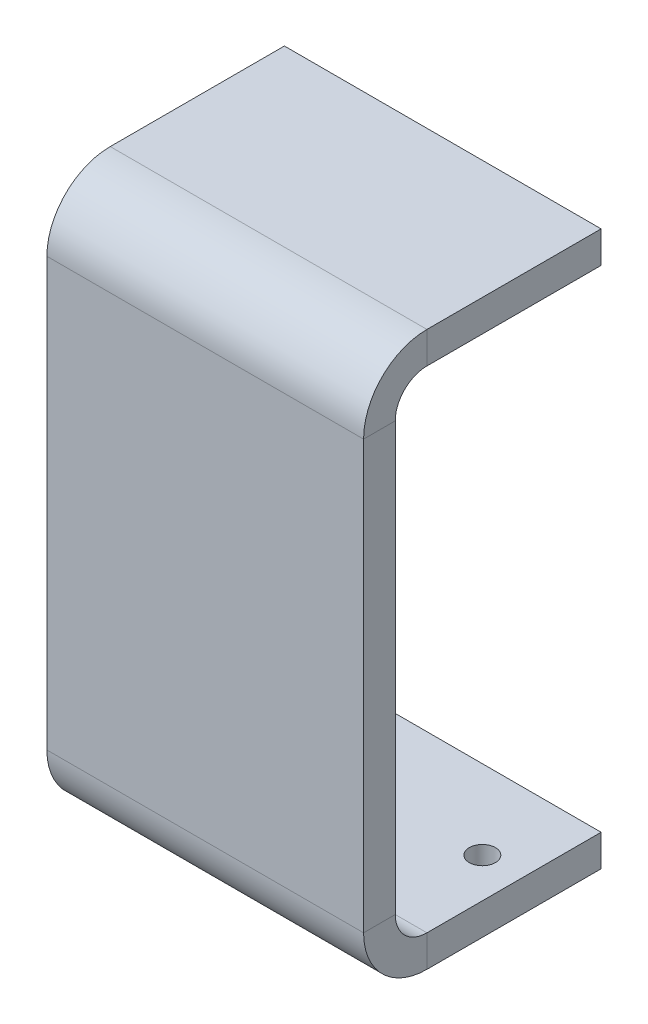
ISO-10303-21;
HEADER;
FILE_DESCRIPTION(('STEP AP214'),'2;1');
FILE_NAME('part.step','',(''),(''),'','','');
FILE_SCHEMA(('AUTOMOTIVE_DESIGN { 1 0 10303 214 1 1 1 1 }'));
ENDSEC;
DATA;
#1=APPLICATION_CONTEXT('core data for automotive mechanical design processes');
#2=APPLICATION_PROTOCOL_DEFINITION('international standard','automotive_design',2000,#1);
#3=PRODUCT_CONTEXT('',#1,'mechanical');
#4=PRODUCT('Part','Part','',(#3));
#5=PRODUCT_RELATED_PRODUCT_CATEGORY('part','',(#4));
#6=PRODUCT_DEFINITION_FORMATION('','',#4);
#7=PRODUCT_DEFINITION_CONTEXT('part definition',#1,'design');
#8=PRODUCT_DEFINITION('design','',#6,#7);
#9=PRODUCT_DEFINITION_SHAPE('','',#8);
#10=(LENGTH_UNIT() NAMED_UNIT(*) SI_UNIT(.MILLI.,.METRE.));
#11=(NAMED_UNIT(*) PLANE_ANGLE_UNIT() SI_UNIT($,.RADIAN.));
#12=(NAMED_UNIT(*) SI_UNIT($,.STERADIAN.) SOLID_ANGLE_UNIT());
#13=UNCERTAINTY_MEASURE_WITH_UNIT(LENGTH_MEASURE(1.E-05),#10,'distance_accuracy_value','');
#14=(GEOMETRIC_REPRESENTATION_CONTEXT(3) GLOBAL_UNCERTAINTY_ASSIGNED_CONTEXT((#13)) GLOBAL_UNIT_ASSIGNED_CONTEXT((#10,
#11,#12)) REPRESENTATION_CONTEXT('',''));
#15=CARTESIAN_POINT('',(0.,0.,0.));
#16=DIRECTION('',(0.,0.,1.));
#17=DIRECTION('',(1.,0.,0.));
#18=AXIS2_PLACEMENT_3D('',#15,#16,#17);
#19=CARTESIAN_POINT('',(20.,8.00000000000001,30.));
#20=DIRECTION('',(1.,0.,0.));
#21=DIRECTION('',(0.,0.,-0.999999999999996));
#22=AXIS2_PLACEMENT_3D('',#19,#20,#21);
#23=PLANE('',#22);
#24=DIRECTION('',(0.,0.,-0.999999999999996));
#25=VECTOR('',#24,1.);
#26=CARTESIAN_POINT('',(20.,8.00000000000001,30.));
#27=LINE('',#26,#25);
#28=CARTESIAN_POINT('',(20.,8.00000000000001,30.));
#29=VERTEX_POINT('',#28);
#30=CARTESIAN_POINT('',(20.,8.00000000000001,26.));
#31=VERTEX_POINT('',#30);
#32=EDGE_CURVE('E11',#29,#31,#27,.T.);
#33=ORIENTED_EDGE('',*,*,#32,.F.);
#34=CARTESIAN_POINT('',(19.9999999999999,8.00000000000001,22.));
#35=DIRECTION('',(1.,0.,0.));
#36=DIRECTION('',(0.,0.,-0.999999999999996));
#37=AXIS2_PLACEMENT_3D('',#34,#35,#36);
#38=CIRCLE('',#37,8.);
#39=CARTESIAN_POINT('',(19.9999999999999,0.,22.));
#40=VERTEX_POINT('',#39);
#41=EDGE_CURVE('E222',#40,#29,#38,.F.);
#42=ORIENTED_EDGE('',*,*,#41,.F.);
#43=DIRECTION('',(0.,-1.,0.));
#44=VECTOR('',#43,1.);
#45=CARTESIAN_POINT('',(19.9999999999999,4.,22.));
#46=LINE('',#45,#44);
#47=CARTESIAN_POINT('',(19.9999999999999,4.,22.));
#48=VERTEX_POINT('',#47);
#49=EDGE_CURVE('E53',#48,#40,#46,.T.);
#50=ORIENTED_EDGE('',*,*,#49,.F.);
#51=CARTESIAN_POINT('',(19.9999999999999,8.00000000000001,22.));
#52=DIRECTION('',(1.,0.,0.));
#53=DIRECTION('',(0.,0.,-0.999999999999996));
#54=AXIS2_PLACEMENT_3D('',#51,#52,#53);
#55=CIRCLE('',#54,4.);
#56=EDGE_CURVE('E237',#48,#31,#55,.F.);
#57=ORIENTED_EDGE('',*,*,#56,.T.);
#58=EDGE_LOOP('',(#33,#42,#50,#57));
#59=FACE_BOUND('',#58,.T.);
#60=ADVANCED_FACE('F44',(#59),#23,.T.);
#61=CARTESIAN_POINT('',(19.9999999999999,4.,22.));
#62=DIRECTION('',(1.,0.,0.));
#63=DIRECTION('',(0.,0.,-0.999999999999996));
#64=AXIS2_PLACEMENT_3D('',#61,#62,#63);
#65=PLANE('',#64);
#66=DIRECTION('',(0.,1.,0.));
#67=VECTOR('',#66,1.);
#68=CARTESIAN_POINT('',(20.,0.,30.));
#69=LINE('',#68,#67);
#70=CARTESIAN_POINT('',(20.,62.0000000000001,29.999999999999));
#71=VERTEX_POINT('',#70);
#72=EDGE_CURVE('E218',#29,#71,#69,.T.);
#73=ORIENTED_EDGE('',*,*,#72,.F.);
#74=ORIENTED_EDGE('',*,*,#32,.T.);
#75=DIRECTION('',(0.,1.,0.));
#76=VECTOR('',#75,1.);
#77=CARTESIAN_POINT('',(20.,0.,26.));
#78=LINE('',#77,#76);
#79=CARTESIAN_POINT('',(20.,62.0000000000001,25.999999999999));
#80=VERTEX_POINT('',#79);
#81=EDGE_CURVE('E241',#31,#80,#78,.T.);
#82=ORIENTED_EDGE('',*,*,#81,.T.);
#83=DIRECTION('',(0.,0.,0.999999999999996));
#84=VECTOR('',#83,1.);
#85=CARTESIAN_POINT('',(20.,62.0000000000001,25.999999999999));
#86=LINE('',#85,#84);
#87=EDGE_CURVE('E68',#80,#71,#86,.T.);
#88=ORIENTED_EDGE('',*,*,#87,.T.);
#89=EDGE_LOOP('',(#73,#74,#82,#88));
#90=FACE_BOUND('',#89,.T.);
#91=ADVANCED_FACE('F353',(#90),#65,.T.);
#92=CARTESIAN_POINT('',(-20.0000000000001,0.,21.9999999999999));
#93=DIRECTION('',(-1.,0.,0.));
#94=DIRECTION('',(0.,0.,0.999999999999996));
#95=AXIS2_PLACEMENT_3D('',#92,#93,#94);
#96=PLANE('',#95);
#97=DIRECTION('',(0.,1.,0.));
#98=VECTOR('',#97,1.);
#99=CARTESIAN_POINT('',(-20.0000000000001,0.,21.9999999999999));
#100=LINE('',#99,#98);
#101=CARTESIAN_POINT('',(-20.0000000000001,0.,21.9999999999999));
#102=VERTEX_POINT('',#101);
#103=CARTESIAN_POINT('',(-20.0000000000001,4.,21.9999999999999));
#104=VERTEX_POINT('',#103);
#105=EDGE_CURVE('E297',#102,#104,#100,.T.);
#106=ORIENTED_EDGE('',*,*,#105,.F.);
#107=CARTESIAN_POINT('',(-20.0000000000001,8.00000000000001,21.9999999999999));
#108=DIRECTION('',(1.,0.,0.));
#109=DIRECTION('',(0.,0.,-0.999999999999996));
#110=AXIS2_PLACEMENT_3D('',#107,#108,#109);
#111=CIRCLE('',#110,8.);
#112=CARTESIAN_POINT('',(-20.,8.00000000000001,29.9999999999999));
#113=VERTEX_POINT('',#112);
#114=EDGE_CURVE('E178',#102,#113,#111,.F.);
#115=ORIENTED_EDGE('',*,*,#114,.T.);
#116=DIRECTION('',(0.,0.,0.999999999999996));
#117=VECTOR('',#116,1.);
#118=CARTESIAN_POINT('',(-20.,8.00000000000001,25.9999999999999));
#119=LINE('',#118,#117);
#120=CARTESIAN_POINT('',(-20.,8.00000000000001,25.9999999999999));
#121=VERTEX_POINT('',#120);
#122=EDGE_CURVE('E294',#121,#113,#119,.T.);
#123=ORIENTED_EDGE('',*,*,#122,.F.);
#124=CARTESIAN_POINT('',(-20.0000000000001,8.00000000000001,21.9999999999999));
#125=DIRECTION('',(1.,0.,0.));
#126=DIRECTION('',(0.,0.,-0.999999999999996));
#127=AXIS2_PLACEMENT_3D('',#124,#125,#126);
#128=CIRCLE('',#127,4.);
#129=EDGE_CURVE('E193',#104,#121,#128,.F.);
#130=ORIENTED_EDGE('',*,*,#129,.F.);
#131=EDGE_LOOP('',(#106,#115,#123,#130));
#132=FACE_BOUND('',#131,.T.);
#133=ADVANCED_FACE('F381',(#132),#96,.T.);
#134=CARTESIAN_POINT('',(-20.,8.00000000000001,25.9999999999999));
#135=DIRECTION('',(-1.,0.,0.));
#136=DIRECTION('',(0.,0.,0.999999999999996));
#137=AXIS2_PLACEMENT_3D('',#134,#135,#136);
#138=PLANE('',#137);
#139=DIRECTION('',(0.,0.,0.999999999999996));
#140=VECTOR('',#139,1.);
#141=CARTESIAN_POINT('',(-20.,0.,-1.11022302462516E-13));
#142=LINE('',#141,#140);
#143=CARTESIAN_POINT('',(-20.,0.,-1.11022302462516E-13));
#144=VERTEX_POINT('',#143);
#145=EDGE_CURVE('E181',#144,#102,#142,.T.);
#146=ORIENTED_EDGE('',*,*,#145,.T.);
#147=ORIENTED_EDGE('',*,*,#105,.T.);
#148=DIRECTION('',(0.,0.,0.999999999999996));
#149=VECTOR('',#148,1.);
#150=CARTESIAN_POINT('',(-20.,4.,-1.11022302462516E-13));
#151=LINE('',#150,#149);
#152=CARTESIAN_POINT('',(-20.,4.,-1.11022302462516E-13));
#153=VERTEX_POINT('',#152);
#154=EDGE_CURVE('E189',#153,#104,#151,.T.);
#155=ORIENTED_EDGE('',*,*,#154,.F.);
#156=DIRECTION('',(0.,-1.,0.));
#157=VECTOR('',#156,1.);
#158=CARTESIAN_POINT('',(-20.,4.,-1.11022302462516E-13));
#159=LINE('',#158,#157);
#160=EDGE_CURVE('E185',#153,#144,#159,.T.);
#161=ORIENTED_EDGE('',*,*,#160,.T.);
#162=EDGE_LOOP('',(#146,#147,#155,#161));
#163=FACE_BOUND('',#162,.T.);
#164=ADVANCED_FACE('F335',(#163),#138,.T.);
#165=CARTESIAN_POINT('',(19.9999999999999,70.0000000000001,21.999999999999));
#166=DIRECTION('',(1.,0.,0.));
#167=DIRECTION('',(0.,0.,-0.999999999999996));
#168=AXIS2_PLACEMENT_3D('',#165,#166,#167);
#169=PLANE('',#168);
#170=DIRECTION('',(0.,-1.,0.));
#171=VECTOR('',#170,1.);
#172=CARTESIAN_POINT('',(19.9999999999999,70.0000000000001,21.999999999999));
#173=LINE('',#172,#171);
#174=CARTESIAN_POINT('',(19.9999999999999,70.0000000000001,21.999999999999));
#175=VERTEX_POINT('',#174);
#176=CARTESIAN_POINT('',(19.9999999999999,66.0000000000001,21.999999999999));
#177=VERTEX_POINT('',#176);
#178=EDGE_CURVE('E61',#175,#177,#173,.T.);
#179=ORIENTED_EDGE('',*,*,#178,.F.);
#180=CARTESIAN_POINT('',(19.9999999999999,62.0000000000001,21.999999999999));
#181=DIRECTION('',(1.,0.,0.));
#182=DIRECTION('',(0.,0.,-0.999999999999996));
#183=AXIS2_PLACEMENT_3D('',#180,#181,#182);
#184=CIRCLE('',#183,8.);
#185=EDGE_CURVE('E214',#71,#175,#184,.F.);
#186=ORIENTED_EDGE('',*,*,#185,.F.);
#187=ORIENTED_EDGE('',*,*,#87,.F.);
#188=CARTESIAN_POINT('',(19.9999999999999,62.0000000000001,21.999999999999));
#189=DIRECTION('',(1.,0.,0.));
#190=DIRECTION('',(0.,0.,-0.999999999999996));
#191=AXIS2_PLACEMENT_3D('',#188,#189,#190);
#192=CIRCLE('',#191,4.);
#193=EDGE_CURVE('E244',#80,#177,#192,.F.);
#194=ORIENTED_EDGE('',*,*,#193,.T.);
#195=EDGE_LOOP('',(#179,#186,#187,#194));
#196=FACE_BOUND('',#195,.T.);
#197=ADVANCED_FACE('F360',(#196),#169,.T.);
#198=CARTESIAN_POINT('',(20.,62.0000000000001,25.999999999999));
#199=DIRECTION('',(1.,0.,0.));
#200=DIRECTION('',(0.,0.,-0.999999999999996));
#201=AXIS2_PLACEMENT_3D('',#198,#199,#200);
#202=PLANE('',#201);
#203=DIRECTION('',(0.,0.,-0.999999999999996));
#204=VECTOR('',#203,1.);
#205=CARTESIAN_POINT('',(20.,70.0000000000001,29.999999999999));
#206=LINE('',#205,#204);
#207=CARTESIAN_POINT('',(20.,70.0000000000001,0.));
#208=VERTEX_POINT('',#207);
#209=EDGE_CURVE('E210',#175,#208,#206,.T.);
#210=ORIENTED_EDGE('',*,*,#209,.F.);
#211=ORIENTED_EDGE('',*,*,#178,.T.);
#212=DIRECTION('',(0.,0.,-0.999999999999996));
#213=VECTOR('',#212,1.);
#214=CARTESIAN_POINT('',(20.,66.0000000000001,29.999999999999));
#215=LINE('',#214,#213);
#216=CARTESIAN_POINT('',(20.,66.0000000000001,0.));
#217=VERTEX_POINT('',#216);
#218=EDGE_CURVE('E205',#177,#217,#215,.T.);
#219=ORIENTED_EDGE('',*,*,#218,.T.);
#220=DIRECTION('',(0.,-1.,0.));
#221=VECTOR('',#220,1.);
#222=CARTESIAN_POINT('',(20.,70.0000000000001,0.));
#223=LINE('',#222,#221);
#224=EDGE_CURVE('E142',#208,#217,#223,.T.);
#225=ORIENTED_EDGE('',*,*,#224,.F.);
#226=EDGE_LOOP('',(#210,#211,#219,#225));
#227=FACE_BOUND('',#226,.T.);
#228=ADVANCED_FACE('F365',(#227),#202,.T.);
#229=CARTESIAN_POINT('',(-20.,62.0000000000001,29.9999999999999));
#230=DIRECTION('',(-1.,0.,0.));
#231=DIRECTION('',(0.,0.,0.999999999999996));
#232=AXIS2_PLACEMENT_3D('',#229,#230,#231);
#233=PLANE('',#232);
#234=DIRECTION('',(0.,0.,-0.999999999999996));
#235=VECTOR('',#234,1.);
#236=CARTESIAN_POINT('',(-20.,62.0000000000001,29.9999999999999));
#237=LINE('',#236,#235);
#238=CARTESIAN_POINT('',(-20.,62.0000000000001,29.9999999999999));
#239=VERTEX_POINT('',#238);
#240=CARTESIAN_POINT('',(-20.,62.0000000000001,25.9999999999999));
#241=VERTEX_POINT('',#240);
#242=EDGE_CURVE('E287',#239,#241,#237,.T.);
#243=ORIENTED_EDGE('',*,*,#242,.F.);
#244=CARTESIAN_POINT('',(-20.0000000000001,62.0000000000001,21.9999999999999));
#245=DIRECTION('',(1.,0.,0.));
#246=DIRECTION('',(0.,0.,-0.999999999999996));
#247=AXIS2_PLACEMENT_3D('',#244,#245,#246);
#248=CIRCLE('',#247,8.);
#249=CARTESIAN_POINT('',(-20.0000000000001,70.0000000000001,21.9999999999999));
#250=VERTEX_POINT('',#249);
#251=EDGE_CURVE('E167',#239,#250,#248,.F.);
#252=ORIENTED_EDGE('',*,*,#251,.T.);
#253=DIRECTION('',(0.,1.,0.));
#254=VECTOR('',#253,1.);
#255=CARTESIAN_POINT('',(-20.0000000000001,66.0000000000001,21.9999999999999));
#256=LINE('',#255,#254);
#257=CARTESIAN_POINT('',(-20.0000000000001,66.0000000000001,21.9999999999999));
#258=VERTEX_POINT('',#257);
#259=EDGE_CURVE('E146',#258,#250,#256,.T.);
#260=ORIENTED_EDGE('',*,*,#259,.F.);
#261=CARTESIAN_POINT('',(-20.0000000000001,62.0000000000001,21.9999999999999));
#262=DIRECTION('',(1.,0.,0.));
#263=DIRECTION('',(0.,0.,-0.999999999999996));
#264=AXIS2_PLACEMENT_3D('',#261,#262,#263);
#265=CIRCLE('',#264,4.);
#266=EDGE_CURVE('E201',#241,#258,#265,.F.);
#267=ORIENTED_EDGE('',*,*,#266,.F.);
#268=EDGE_LOOP('',(#243,#252,#260,#267));
#269=FACE_BOUND('',#268,.T.);
#270=ADVANCED_FACE('F367',(#269),#233,.T.);
#271=CARTESIAN_POINT('',(-20.0000000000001,66.0000000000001,21.9999999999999));
#272=DIRECTION('',(-1.,0.,0.));
#273=DIRECTION('',(0.,0.,0.999999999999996));
#274=AXIS2_PLACEMENT_3D('',#271,#272,#273);
#275=PLANE('',#274);
#276=DIRECTION('',(0.,1.,0.));
#277=VECTOR('',#276,1.);
#278=CARTESIAN_POINT('',(-20.,0.,29.9999999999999));
#279=LINE('',#278,#277);
#280=EDGE_CURVE('E174',#113,#239,#279,.T.);
#281=ORIENTED_EDGE('',*,*,#280,.T.);
#282=ORIENTED_EDGE('',*,*,#242,.T.);
#283=DIRECTION('',(0.,1.,0.));
#284=VECTOR('',#283,1.);
#285=CARTESIAN_POINT('',(-20.,0.,25.9999999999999));
#286=LINE('',#285,#284);
#287=EDGE_CURVE('E197',#121,#241,#286,.T.);
#288=ORIENTED_EDGE('',*,*,#287,.F.);
#289=ORIENTED_EDGE('',*,*,#122,.T.);
#290=EDGE_LOOP('',(#281,#282,#288,#289));
#291=FACE_BOUND('',#290,.T.);
#292=ADVANCED_FACE('F373',(#291),#275,.T.);
#293=CARTESIAN_POINT('',(20.,66.0000000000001,29.999999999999));
#294=DIRECTION('',(0.,1.,0.));
#295=DIRECTION('',(0.,0.,0.999999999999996));
#296=AXIS2_PLACEMENT_3D('',#293,#294,#295);
#297=PLANE('',#296);
#298=DIRECTION('',(0.,0.,-0.999999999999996));
#299=VECTOR('',#298,1.);
#300=CARTESIAN_POINT('',(-20.,66.0000000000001,29.9999999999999));
#301=LINE('',#300,#299);
#302=CARTESIAN_POINT('',(-20.,66.0000000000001,-1.11022302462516E-13));
#303=VERTEX_POINT('',#302);
#304=EDGE_CURVE('E151',#258,#303,#301,.T.);
#305=ORIENTED_EDGE('',*,*,#304,.T.);
#306=DIRECTION('',(-1.,0.,0.));
#307=VECTOR('',#306,1.);
#308=CARTESIAN_POINT('',(20.,66.0000000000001,0.));
#309=LINE('',#308,#307);
#310=EDGE_CURVE('E135',#217,#303,#309,.T.);
#311=ORIENTED_EDGE('',*,*,#310,.F.);
#312=ORIENTED_EDGE('',*,*,#218,.F.);
#313=DIRECTION('',(-1.,0.,0.));
#314=VECTOR('',#313,1.);
#315=CARTESIAN_POINT('',(19.9999999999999,66.0000000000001,21.999999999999));
#316=LINE('',#315,#314);
#317=EDGE_CURVE('E154',#177,#258,#316,.T.);
#318=ORIENTED_EDGE('',*,*,#317,.T.);
#319=EDGE_LOOP('',(#305,#311,#312,#318));
#320=FACE_BOUND('',#319,.T.);
#321=ADVANCED_FACE('F152',(#320),#297,.F.);
#322=CARTESIAN_POINT('',(20.,70.0000000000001,0.));
#323=DIRECTION('',(0.,0.,-0.999999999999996));
#324=DIRECTION('',(-1.,0.,0.));
#325=AXIS2_PLACEMENT_3D('',#322,#323,#324);
#326=PLANE('',#325);
#327=DIRECTION('',(0.,-1.,0.));
#328=VECTOR('',#327,1.);
#329=CARTESIAN_POINT('',(-20.,70.0000000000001,-1.11022302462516E-13));
#330=LINE('',#329,#328);
#331=CARTESIAN_POINT('',(-20.,70.0000000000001,-1.11022302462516E-13));
#332=VERTEX_POINT('',#331);
#333=EDGE_CURVE('E139',#332,#303,#330,.T.);
#334=ORIENTED_EDGE('',*,*,#333,.F.);
#335=DIRECTION('',(-1.,0.,0.));
#336=VECTOR('',#335,1.);
#337=CARTESIAN_POINT('',(20.,70.0000000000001,0.));
#338=LINE('',#337,#336);
#339=EDGE_CURVE('E147',#208,#332,#338,.T.);
#340=ORIENTED_EDGE('',*,*,#339,.F.);
#341=ORIENTED_EDGE('',*,*,#224,.T.);
#342=ORIENTED_EDGE('',*,*,#310,.T.);
#343=EDGE_LOOP('',(#334,#340,#341,#342));
#344=FACE_BOUND('',#343,.T.);
#345=ADVANCED_FACE('F137',(#344),#326,.T.);
#346=CARTESIAN_POINT('',(20.,70.0000000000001,29.999999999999));
#347=DIRECTION('',(0.,1.,0.));
#348=DIRECTION('',(0.,0.,0.999999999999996));
#349=AXIS2_PLACEMENT_3D('',#346,#347,#348);
#350=PLANE('',#349);
#351=DIRECTION('',(0.,0.,-0.999999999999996));
#352=VECTOR('',#351,1.);
#353=CARTESIAN_POINT('',(-20.,70.0000000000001,29.9999999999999));
#354=LINE('',#353,#352);
#355=EDGE_CURVE('E161',#250,#332,#354,.T.);
#356=ORIENTED_EDGE('',*,*,#355,.F.);
#357=DIRECTION('',(-1.,0.,0.));
#358=VECTOR('',#357,1.);
#359=CARTESIAN_POINT('',(19.9999999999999,70.0000000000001,21.999999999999));
#360=LINE('',#359,#358);
#361=EDGE_CURVE('E279',#175,#250,#360,.T.);
#362=ORIENTED_EDGE('',*,*,#361,.F.);
#363=ORIENTED_EDGE('',*,*,#209,.T.);
#364=ORIENTED_EDGE('',*,*,#339,.T.);
#365=EDGE_LOOP('',(#356,#362,#363,#364));
#366=FACE_BOUND('',#365,.T.);
#367=ADVANCED_FACE('F364',(#366),#350,.T.);
#368=CARTESIAN_POINT('',(19.9999999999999,62.0000000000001,21.999999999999));
#369=DIRECTION('',(-1.,0.,0.));
#370=DIRECTION('',(0.,0.,0.999999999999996));
#371=AXIS2_PLACEMENT_3D('',#368,#369,#370);
#372=CYLINDRICAL_SURFACE('',#371,8.);
#373=ORIENTED_EDGE('',*,*,#251,.F.);
#374=DIRECTION('',(-1.,0.,0.));
#375=VECTOR('',#374,1.);
#376=CARTESIAN_POINT('',(20.,62.0000000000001,29.999999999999));
#377=LINE('',#376,#375);
#378=EDGE_CURVE('E275',#71,#239,#377,.T.);
#379=ORIENTED_EDGE('',*,*,#378,.F.);
#380=ORIENTED_EDGE('',*,*,#185,.T.);
#381=ORIENTED_EDGE('',*,*,#361,.T.);
#382=EDGE_LOOP('',(#373,#379,#380,#381));
#383=FACE_BOUND('',#382,.T.);
#384=ADVANCED_FACE('F359',(#383),#372,.T.);
#385=CARTESIAN_POINT('',(20.,0.,30.));
#386=DIRECTION('',(0.,0.,0.999999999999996));
#387=DIRECTION('',(1.,0.,0.));
#388=AXIS2_PLACEMENT_3D('',#385,#386,#387);
#389=PLANE('',#388);
#390=ORIENTED_EDGE('',*,*,#280,.F.);
#391=DIRECTION('',(-1.,0.,0.));
#392=VECTOR('',#391,1.);
#393=CARTESIAN_POINT('',(20.,8.00000000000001,30.));
#394=LINE('',#393,#392);
#395=EDGE_CURVE('E271',#29,#113,#394,.T.);
#396=ORIENTED_EDGE('',*,*,#395,.F.);
#397=ORIENTED_EDGE('',*,*,#72,.T.);
#398=ORIENTED_EDGE('',*,*,#378,.T.);
#399=EDGE_LOOP('',(#390,#396,#397,#398));
#400=FACE_BOUND('',#399,.T.);
#401=ADVANCED_FACE('F352',(#400),#389,.T.);
#402=CARTESIAN_POINT('',(19.9999999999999,8.00000000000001,22.));
#403=DIRECTION('',(-1.,0.,0.));
#404=DIRECTION('',(0.,0.,0.999999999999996));
#405=AXIS2_PLACEMENT_3D('',#402,#403,#404);
#406=CYLINDRICAL_SURFACE('',#405,8.);
#407=ORIENTED_EDGE('',*,*,#114,.F.);
#408=DIRECTION('',(-1.,0.,0.));
#409=VECTOR('',#408,1.);
#410=CARTESIAN_POINT('',(19.9999999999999,0.,22.));
#411=LINE('',#410,#409);
#412=EDGE_CURVE('E267',#40,#102,#411,.T.);
#413=ORIENTED_EDGE('',*,*,#412,.F.);
#414=ORIENTED_EDGE('',*,*,#41,.T.);
#415=ORIENTED_EDGE('',*,*,#395,.T.);
#416=EDGE_LOOP('',(#407,#413,#414,#415));
#417=FACE_BOUND('',#416,.T.);
#418=ADVANCED_FACE('F325',(#417),#406,.T.);
#419=CARTESIAN_POINT('',(20.,0.,0.));
#420=DIRECTION('',(0.,-1.,0.));
#421=DIRECTION('',(0.,0.,-0.999999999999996));
#422=AXIS2_PLACEMENT_3D('',#419,#420,#421);
#423=PLANE('',#422);
#424=CARTESIAN_POINT('',(15.,0.,10.));
#425=DIRECTION('',(0.,-1.,0.));
#426=DIRECTION('',(0.,0.,-0.999999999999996));
#427=AXIS2_PLACEMENT_3D('',#424,#425,#426);
#428=CIRCLE('',#427,1.64999999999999);
#429=CARTESIAN_POINT('',(15.,0.,8.35000000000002));
#430=VERTEX_POINT('',#429);
#431=EDGE_CURVE('E313',#430,#430,#428,.T.);
#432=ORIENTED_EDGE('',*,*,#431,.F.);
#433=EDGE_LOOP('',(#432));
#434=FACE_BOUND('',#433,.T.);
#435=CARTESIAN_POINT('',(-15.,0.,10.));
#436=DIRECTION('',(0.,-1.,0.));
#437=DIRECTION('',(0.,0.,-0.999999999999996));
#438=AXIS2_PLACEMENT_3D('',#435,#436,#437);
#439=CIRCLE('',#438,1.64999999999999);
#440=CARTESIAN_POINT('',(-15.,0.,8.35000000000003));
#441=VERTEX_POINT('',#440);
#442=EDGE_CURVE('E303',#441,#441,#439,.T.);
#443=ORIENTED_EDGE('',*,*,#442,.F.);
#444=EDGE_LOOP('',(#443));
#445=FACE_BOUND('',#444,.T.);
#446=ORIENTED_EDGE('',*,*,#145,.F.);
#447=DIRECTION('',(-1.,0.,0.));
#448=VECTOR('',#447,1.);
#449=CARTESIAN_POINT('',(20.,0.,0.));
#450=LINE('',#449,#448);
#451=CARTESIAN_POINT('',(20.,0.,0.));
#452=VERTEX_POINT('',#451);
#453=EDGE_CURVE('E264',#452,#144,#450,.T.);
#454=ORIENTED_EDGE('',*,*,#453,.F.);
#455=DIRECTION('',(0.,0.,0.999999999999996));
#456=VECTOR('',#455,1.);
#457=CARTESIAN_POINT('',(20.,0.,0.));
#458=LINE('',#457,#456);
#459=EDGE_CURVE('E226',#452,#40,#458,.T.);
#460=ORIENTED_EDGE('',*,*,#459,.T.);
#461=ORIENTED_EDGE('',*,*,#412,.T.);
#462=EDGE_LOOP('',(#446,#454,#460,#461));
#463=FACE_BOUND('',#462,.T.);
#464=ADVANCED_FACE('F321',(#434,#445,#463),#423,.T.);
#465=CARTESIAN_POINT('',(20.,4.,0.));
#466=DIRECTION('',(0.,0.,-0.999999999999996));
#467=DIRECTION('',(0.,1.,0.));
#468=AXIS2_PLACEMENT_3D('',#465,#466,#467);
#469=PLANE('',#468);
#470=ORIENTED_EDGE('',*,*,#160,.F.);
#471=DIRECTION('',(-1.,0.,0.));
#472=VECTOR('',#471,1.);
#473=CARTESIAN_POINT('',(20.,4.,0.));
#474=LINE('',#473,#472);
#475=CARTESIAN_POINT('',(20.,4.,0.));
#476=VERTEX_POINT('',#475);
#477=EDGE_CURVE('E261',#476,#153,#474,.T.);
#478=ORIENTED_EDGE('',*,*,#477,.F.);
#479=DIRECTION('',(0.,-1.,0.));
#480=VECTOR('',#479,1.);
#481=CARTESIAN_POINT('',(20.,4.,0.));
#482=LINE('',#481,#480);
#483=EDGE_CURVE('E230',#476,#452,#482,.T.);
#484=ORIENTED_EDGE('',*,*,#483,.T.);
#485=ORIENTED_EDGE('',*,*,#453,.T.);
#486=EDGE_LOOP('',(#470,#478,#484,#485));
#487=FACE_BOUND('',#486,.T.);
#488=ADVANCED_FACE('F324',(#487),#469,.T.);
#489=CARTESIAN_POINT('',(20.,4.,0.));
#490=DIRECTION('',(0.,-1.,0.));
#491=DIRECTION('',(0.,0.,-0.999999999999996));
#492=AXIS2_PLACEMENT_3D('',#489,#490,#491);
#493=PLANE('',#492);
#494=CARTESIAN_POINT('',(15.,4.,10.));
#495=DIRECTION('',(0.,-1.,0.));
#496=DIRECTION('',(0.,0.,-0.999999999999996));
#497=AXIS2_PLACEMENT_3D('',#494,#495,#496);
#498=CIRCLE('',#497,1.64999999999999);
#499=CARTESIAN_POINT('',(15.,4.,8.35000000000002));
#500=VERTEX_POINT('',#499);
#501=EDGE_CURVE('E47',#500,#500,#498,.T.);
#502=ORIENTED_EDGE('',*,*,#501,.T.);
#503=EDGE_LOOP('',(#502));
#504=FACE_BOUND('',#503,.T.);
#505=CARTESIAN_POINT('',(-15.,4.,10.));
#506=DIRECTION('',(0.,-1.,0.));
#507=DIRECTION('',(0.,0.,-0.999999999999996));
#508=AXIS2_PLACEMENT_3D('',#505,#506,#507);
#509=CIRCLE('',#508,1.64999999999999);
#510=CARTESIAN_POINT('',(-15.,4.,8.35000000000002));
#511=VERTEX_POINT('',#510);
#512=EDGE_CURVE('E157',#511,#511,#509,.T.);
#513=ORIENTED_EDGE('',*,*,#512,.T.);
#514=EDGE_LOOP('',(#513));
#515=FACE_BOUND('',#514,.T.);
#516=ORIENTED_EDGE('',*,*,#154,.T.);
#517=DIRECTION('',(-1.,0.,0.));
#518=VECTOR('',#517,1.);
#519=CARTESIAN_POINT('',(19.9999999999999,4.,22.));
#520=LINE('',#519,#518);
#521=EDGE_CURVE('E257',#48,#104,#520,.T.);
#522=ORIENTED_EDGE('',*,*,#521,.F.);
#523=DIRECTION('',(0.,0.,0.999999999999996));
#524=VECTOR('',#523,1.);
#525=CARTESIAN_POINT('',(20.,4.,0.));
#526=LINE('',#525,#524);
#527=EDGE_CURVE('E234',#476,#48,#526,.T.);
#528=ORIENTED_EDGE('',*,*,#527,.F.);
#529=ORIENTED_EDGE('',*,*,#477,.T.);
#530=EDGE_LOOP('',(#516,#522,#528,#529));
#531=FACE_BOUND('',#530,.T.);
#532=ADVANCED_FACE('F468',(#504,#515,#531),#493,.F.);
#533=CARTESIAN_POINT('',(19.9999999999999,8.00000000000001,22.));
#534=DIRECTION('',(-1.,0.,0.));
#535=DIRECTION('',(0.,0.,0.999999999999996));
#536=AXIS2_PLACEMENT_3D('',#533,#534,#535);
#537=CYLINDRICAL_SURFACE('',#536,4.);
#538=ORIENTED_EDGE('',*,*,#129,.T.);
#539=DIRECTION('',(-1.,0.,0.));
#540=VECTOR('',#539,1.);
#541=CARTESIAN_POINT('',(20.,8.00000000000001,26.));
#542=LINE('',#541,#540);
#543=EDGE_CURVE('E253',#31,#121,#542,.T.);
#544=ORIENTED_EDGE('',*,*,#543,.F.);
#545=ORIENTED_EDGE('',*,*,#56,.F.);
#546=ORIENTED_EDGE('',*,*,#521,.T.);
#547=EDGE_LOOP('',(#538,#544,#545,#546));
#548=FACE_BOUND('',#547,.T.);
#549=ADVANCED_FACE('F476',(#548),#537,.F.);
#550=CARTESIAN_POINT('',(20.,0.,26.));
#551=DIRECTION('',(0.,0.,0.999999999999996));
#552=DIRECTION('',(1.,0.,0.));
#553=AXIS2_PLACEMENT_3D('',#550,#551,#552);
#554=PLANE('',#553);
#555=ORIENTED_EDGE('',*,*,#287,.T.);
#556=DIRECTION('',(-1.,0.,0.));
#557=VECTOR('',#556,1.);
#558=CARTESIAN_POINT('',(20.,62.0000000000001,25.999999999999));
#559=LINE('',#558,#557);
#560=EDGE_CURVE('E249',#80,#241,#559,.T.);
#561=ORIENTED_EDGE('',*,*,#560,.F.);
#562=ORIENTED_EDGE('',*,*,#81,.F.);
#563=ORIENTED_EDGE('',*,*,#543,.T.);
#564=EDGE_LOOP('',(#555,#561,#562,#563));
#565=FACE_BOUND('',#564,.T.);
#566=ADVANCED_FACE('F485',(#565),#554,.F.);
#567=CARTESIAN_POINT('',(19.9999999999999,62.0000000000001,21.999999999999));
#568=DIRECTION('',(-1.,0.,0.));
#569=DIRECTION('',(0.,0.,0.999999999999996));
#570=AXIS2_PLACEMENT_3D('',#567,#568,#569);
#571=CYLINDRICAL_SURFACE('',#570,4.);
#572=ORIENTED_EDGE('',*,*,#266,.T.);
#573=ORIENTED_EDGE('',*,*,#317,.F.);
#574=ORIENTED_EDGE('',*,*,#193,.F.);
#575=ORIENTED_EDGE('',*,*,#560,.T.);
#576=EDGE_LOOP('',(#572,#573,#574,#575));
#577=FACE_BOUND('',#576,.T.);
#578=ADVANCED_FACE('F494',(#577),#571,.F.);
#579=CARTESIAN_POINT('',(19.9999999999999,62.0000000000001,21.999999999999));
#580=DIRECTION('',(1.,0.,0.));
#581=DIRECTION('',(0.,0.,-0.999999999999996));
#582=AXIS2_PLACEMENT_3D('',#579,#580,#581);
#583=PLANE('',#582);
#584=ORIENTED_EDGE('',*,*,#527,.T.);
#585=ORIENTED_EDGE('',*,*,#49,.T.);
#586=ORIENTED_EDGE('',*,*,#459,.F.);
#587=ORIENTED_EDGE('',*,*,#483,.F.);
#588=EDGE_LOOP('',(#584,#585,#586,#587));
#589=FACE_BOUND('',#588,.T.);
#590=ADVANCED_FACE('F340',(#589),#583,.T.);
#591=CARTESIAN_POINT('',(-20.0000000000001,62.0000000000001,21.9999999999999));
#592=DIRECTION('',(1.,0.,0.));
#593=DIRECTION('',(0.,0.,-0.999999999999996));
#594=AXIS2_PLACEMENT_3D('',#591,#592,#593);
#595=PLANE('',#594);
#596=ORIENTED_EDGE('',*,*,#304,.F.);
#597=ORIENTED_EDGE('',*,*,#259,.T.);
#598=ORIENTED_EDGE('',*,*,#355,.T.);
#599=ORIENTED_EDGE('',*,*,#333,.T.);
#600=EDGE_LOOP('',(#596,#597,#598,#599));
#601=FACE_BOUND('',#600,.T.);
#602=ADVANCED_FACE('F159',(#601),#595,.F.);
#603=CARTESIAN_POINT('',(-15.,0.,10.));
#604=DIRECTION('',(0.,-1.,0.));
#605=DIRECTION('',(0.,0.,-0.999999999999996));
#606=AXIS2_PLACEMENT_3D('',#603,#604,#605);
#607=CYLINDRICAL_SURFACE('',#606,1.64999999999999);
#608=ORIENTED_EDGE('',*,*,#442,.T.);
#609=EDGE_LOOP('',(#608));
#610=FACE_BOUND('',#609,.T.);
#611=ORIENTED_EDGE('',*,*,#512,.F.);
#612=EDGE_LOOP('',(#611));
#613=FACE_BOUND('',#612,.T.);
#614=ADVANCED_FACE('F518',(#610,#613),#607,.F.);
#615=CARTESIAN_POINT('',(15.,0.,10.));
#616=DIRECTION('',(0.,-1.,0.));
#617=DIRECTION('',(0.,0.,-0.999999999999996));
#618=AXIS2_PLACEMENT_3D('',#615,#616,#617);
#619=CYLINDRICAL_SURFACE('',#618,1.64999999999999);
#620=ORIENTED_EDGE('',*,*,#431,.T.);
#621=EDGE_LOOP('',(#620));
#622=FACE_BOUND('',#621,.T.);
#623=ORIENTED_EDGE('',*,*,#501,.F.);
#624=EDGE_LOOP('',(#623));
#625=FACE_BOUND('',#624,.T.);
#626=ADVANCED_FACE('F318',(#622,#625),#619,.F.);
#627=CLOSED_SHELL('',(#60,#91,#133,#164,#197,#228,#270,#292,#321,#345,#367,#384,#401,#418,#464,
#488,#532,#549,#566,#578,#590,#602,#614,#626));
#628=MANIFOLD_SOLID_BREP('B2',#627);
#629=ADVANCED_BREP_SHAPE_REPRESENTATION('',(#18,#628),#14);
#630=SHAPE_DEFINITION_REPRESENTATION(#9,#629);
ENDSEC;
END-ISO-10303-21;
